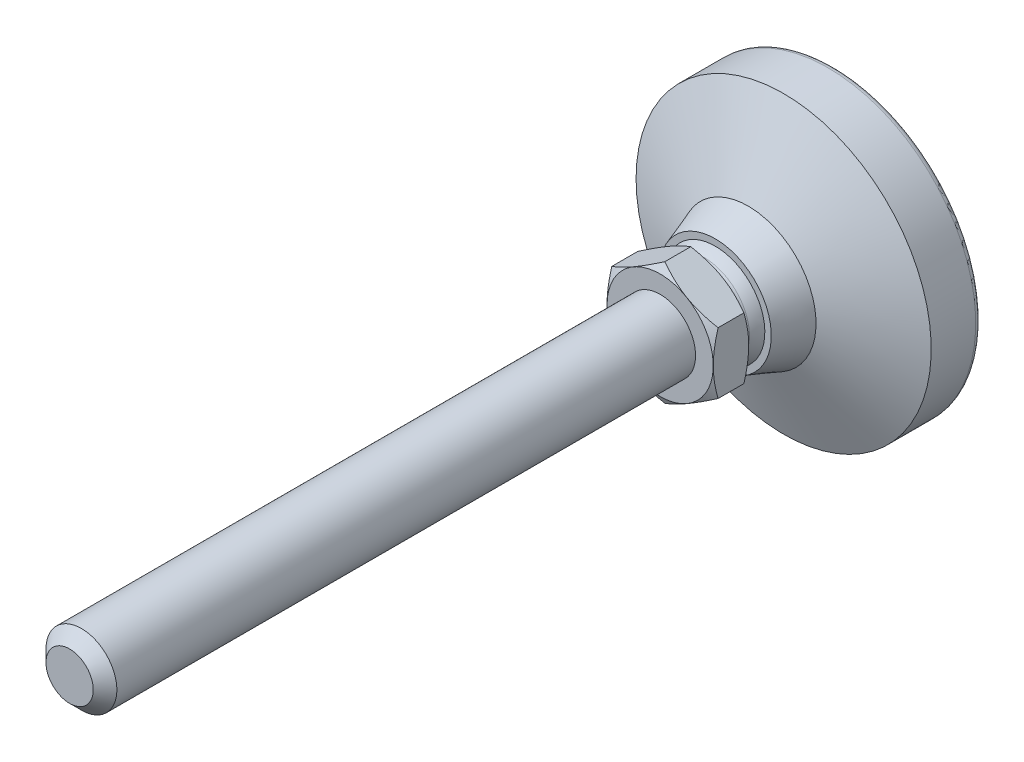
ISO-10303-21;
HEADER;
FILE_DESCRIPTION(('STEP AP214'),'2;1');
FILE_NAME('part.step','',(''),(''),'','','');
FILE_SCHEMA(('AUTOMOTIVE_DESIGN { 1 0 10303 214 1 1 1 1 }'));
ENDSEC;
DATA;
#1=APPLICATION_CONTEXT('core data for automotive mechanical design processes');
#2=APPLICATION_PROTOCOL_DEFINITION('international standard','automotive_design',2000,#1);
#3=PRODUCT_CONTEXT('',#1,'mechanical');
#4=PRODUCT('Part','Part','',(#3));
#5=PRODUCT_RELATED_PRODUCT_CATEGORY('part','',(#4));
#6=PRODUCT_DEFINITION_FORMATION('','',#4);
#7=PRODUCT_DEFINITION_CONTEXT('part definition',#1,'design');
#8=PRODUCT_DEFINITION('design','',#6,#7);
#9=PRODUCT_DEFINITION_SHAPE('','',#8);
#10=(LENGTH_UNIT() NAMED_UNIT(*) SI_UNIT(.MILLI.,.METRE.));
#11=(NAMED_UNIT(*) PLANE_ANGLE_UNIT() SI_UNIT($,.RADIAN.));
#12=(NAMED_UNIT(*) SI_UNIT($,.STERADIAN.) SOLID_ANGLE_UNIT());
#13=UNCERTAINTY_MEASURE_WITH_UNIT(LENGTH_MEASURE(1.E-05),#10,'distance_accuracy_value','');
#14=(GEOMETRIC_REPRESENTATION_CONTEXT(3) GLOBAL_UNCERTAINTY_ASSIGNED_CONTEXT((#13)) GLOBAL_UNIT_ASSIGNED_CONTEXT((#10,
#11,#12)) REPRESENTATION_CONTEXT('',''));
#15=CARTESIAN_POINT('',(0.,0.,0.));
#16=DIRECTION('',(0.,0.,1.));
#17=DIRECTION('',(1.,0.,0.));
#18=AXIS2_PLACEMENT_3D('',#15,#16,#17);
#19=CARTESIAN_POINT('',(0.,0.,24.2721236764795));
#20=DIRECTION('',(0.,0.,1.));
#21=DIRECTION('',(1.,0.,0.));
#22=AXIS2_PLACEMENT_3D('',#19,#20,#21);
#23=CONICAL_SURFACE('',#22,10.3923213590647,1.04719757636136);
#24=CARTESIAN_POINT('',(0.,0.,23.464430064));
#25=DIRECTION('',(0.,0.,-1.));
#26=DIRECTION('',(-1.,0.,0.));
#27=AXIS2_PLACEMENT_3D('',#24,#25,#26);
#28=CIRCLE('',#27,8.99335490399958);
#29=CARTESIAN_POINT('',(-8.99335490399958,0.,23.464430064));
#30=VERTEX_POINT('',#29);
#31=EDGE_CURVE('E258',#30,#30,#28,.T.);
#32=ORIENTED_EDGE('',*,*,#31,.F.);
#33=EDGE_LOOP('',(#32));
#34=FACE_BOUND('',#33,.T.);
#35=CARTESIAN_POINT('',(0.000199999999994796,10.3924203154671,24.272180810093));
#36=CARTESIAN_POINT('',(-0.197607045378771,10.2782163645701,24.2062485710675));
#37=CARTESIAN_POINT('',(-0.396185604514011,10.1635669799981,24.1433079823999));
#38=CARTESIAN_POINT('',(-0.794955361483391,9.93333715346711,24.0242355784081));
#39=CARTESIAN_POINT('',(-0.99514721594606,9.81775633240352,23.9681067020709));
#40=CARTESIAN_POINT('',(-1.39751504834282,9.585449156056,23.8634185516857));
#41=CARTESIAN_POINT('',(-1.59969458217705,9.46872074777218,23.8148773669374));
#42=CARTESIAN_POINT('',(-2.00542874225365,9.23447002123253,23.726415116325));
#43=CARTESIAN_POINT('',(-2.2089830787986,9.11694787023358,23.6864922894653));
#44=CARTESIAN_POINT('',(-2.61230588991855,8.88408933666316,23.6169512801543));
#45=CARTESIAN_POINT('',(-2.81204457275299,8.76877015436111,23.587104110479));
#46=CARTESIAN_POINT('',(-3.2124156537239,8.53761580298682,23.5370599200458));
#47=CARTESIAN_POINT('',(-3.4130479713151,8.42178068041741,23.5168620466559));
#48=CARTESIAN_POINT('',(-3.81466060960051,8.18990951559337,23.486620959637));
#49=CARTESIAN_POINT('',(-4.01564027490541,8.07387385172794,23.4765662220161));
#50=CARTESIAN_POINT('',(-4.41778456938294,7.84169573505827,23.4668289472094));
#51=CARTESIAN_POINT('',(-4.618949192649,7.72555328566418,23.4671460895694));
#52=CARTESIAN_POINT('',(-4.99503258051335,7.50842144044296,23.4774305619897));
#53=CARTESIAN_POINT('',(-5.16997786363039,7.40741673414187,23.4861433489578));
#54=CARTESIAN_POINT('',(-5.5194586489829,7.205643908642,23.5112439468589));
#55=CARTESIAN_POINT('',(-5.69399412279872,7.1048758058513,23.5276322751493));
#56=CARTESIAN_POINT('',(-6.21692485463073,6.80296160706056,23.5879231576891));
#57=CARTESIAN_POINT('',(-6.56439449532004,6.60234991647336,23.6429440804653));
#58=CARTESIAN_POINT('',(-7.26301961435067,6.19899851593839,23.7804970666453));
#59=CARTESIAN_POINT('',(-7.61408593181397,5.99631028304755,23.863612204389));
#60=CARTESIAN_POINT('',(-8.31098329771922,5.59395640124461,24.0522491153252));
#61=CARTESIAN_POINT('',(-8.65682327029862,5.39428559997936,24.1577265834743));
#62=CARTESIAN_POINT('',(-9.0002,5.19603695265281,24.2721808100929));
#63=B_SPLINE_CURVE_WITH_KNOTS('',3,(#35,#36,#37,#38,#39,#40,#41,#42,#43,#44,#45,#46,#47,#48,#49,
#50,#51,#52,#53,#54,#55,#56,#57,#58,#59,#60,#61,#62),.UNSPECIFIED.,.F.,.F.,(4,2,2,2,2,2,2,2,2,2,
2,2,2,4),(0.,0.713219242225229,1.42674512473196,2.14194695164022,2.85700250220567,
3.55449745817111,4.25193077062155,4.94857080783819,5.64518932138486,6.25162972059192,
6.85811100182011,8.07193744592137,9.31268389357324,10.5509947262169),.UNSPECIFIED.);
#64=CARTESIAN_POINT('',(0.,10.392313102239,24.2721189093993));
#65=VERTEX_POINT('',#64);
#66=CARTESIAN_POINT('',(-9.00000715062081,5.1961565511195,24.2721189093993));
#67=VERTEX_POINT('',#66);
#68=EDGE_CURVE('E9',#65,#67,#63,.T.);
#69=ORIENTED_EDGE('',*,*,#68,.F.);
#70=CARTESIAN_POINT('',(9.0002,5.19603695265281,24.2721808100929));
#71=CARTESIAN_POINT('',(8.80239295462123,5.31024090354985,24.2062485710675));
#72=CARTESIAN_POINT('',(8.60381439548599,5.42489028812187,24.1433079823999));
#73=CARTESIAN_POINT('',(8.20504463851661,5.65512011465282,24.0242355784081));
#74=CARTESIAN_POINT('',(8.00485278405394,5.77070093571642,23.9681067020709));
#75=CARTESIAN_POINT('',(7.60248495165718,6.00300811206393,23.8634185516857));
#76=CARTESIAN_POINT('',(7.40030541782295,6.11973652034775,23.8148773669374));
#77=CARTESIAN_POINT('',(6.99457125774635,6.3539872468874,23.726415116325));
#78=CARTESIAN_POINT('',(6.7910169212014,6.47150939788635,23.6864922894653));
#79=CARTESIAN_POINT('',(6.38769411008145,6.70436793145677,23.6169512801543));
#80=CARTESIAN_POINT('',(6.18795542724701,6.81968711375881,23.587104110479));
#81=CARTESIAN_POINT('',(5.7875843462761,7.05084146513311,23.5370599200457));
#82=CARTESIAN_POINT('',(5.58695202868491,7.16667658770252,23.5168620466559));
#83=CARTESIAN_POINT('',(5.18533939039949,7.39854775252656,23.486620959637));
#84=CARTESIAN_POINT('',(4.98435972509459,7.51458341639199,23.4765662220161));
#85=CARTESIAN_POINT('',(4.58221543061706,7.74676153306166,23.4668289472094));
#86=CARTESIAN_POINT('',(4.38105080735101,7.86290398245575,23.4671460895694));
#87=CARTESIAN_POINT('',(4.00496741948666,8.08003582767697,23.4774305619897));
#88=CARTESIAN_POINT('',(3.83002213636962,8.18104053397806,23.4861433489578));
#89=CARTESIAN_POINT('',(3.48054135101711,8.38281335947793,23.5112439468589));
#90=CARTESIAN_POINT('',(3.30600587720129,8.48358146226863,23.5276322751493));
#91=CARTESIAN_POINT('',(2.78307514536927,8.78549566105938,23.5879231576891));
#92=CARTESIAN_POINT('',(2.43560550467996,8.98610735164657,23.6429440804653));
#93=CARTESIAN_POINT('',(1.73698038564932,9.38945875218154,23.7804970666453));
#94=CARTESIAN_POINT('',(1.38591406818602,9.59214698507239,23.863612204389));
#95=CARTESIAN_POINT('',(0.689016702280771,9.99450086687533,24.0522491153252));
#96=CARTESIAN_POINT('',(0.343176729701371,10.1941716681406,24.1577265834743));
#97=CARTESIAN_POINT('',(-0.00020000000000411,10.3924203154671,24.272180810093));
#98=B_SPLINE_CURVE_WITH_KNOTS('',3,(#70,#71,#72,#73,#74,#75,#76,#77,#78,#79,#80,#81,#82,#83,#84,
#85,#86,#87,#88,#89,#90,#91,#92,#93,#94,#95,#96,#97),.UNSPECIFIED.,.F.,.F.,(4,2,2,2,2,2,2,2,2,2,
2,2,2,4),(0.,0.713219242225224,1.42674512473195,2.14194695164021,2.85700250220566,
3.5544974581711,4.25193077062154,4.94857080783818,5.64518932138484,6.2516297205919,
6.8581110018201,8.07193744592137,9.31268389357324,10.5509947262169),.UNSPECIFIED.);
#99=CARTESIAN_POINT('',(9.00000715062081,5.1961565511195,24.2721189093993));
#100=VERTEX_POINT('',#99);
#101=EDGE_CURVE('E70',#100,#65,#98,.T.);
#102=ORIENTED_EDGE('',*,*,#101,.F.);
#103=CARTESIAN_POINT('',(9.,-13.7804311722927,27.7747501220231));
#104=CARTESIAN_POINT('',(9.,-13.5828651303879,27.6792507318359));
#105=CARTESIAN_POINT('',(9.,-13.3850602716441,27.5842456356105));
#106=CARTESIAN_POINT('',(9.,-12.9889224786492,27.3953374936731));
#107=CARTESIAN_POINT('',(9.,-12.7905895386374,27.3014344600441));
#108=CARTESIAN_POINT('',(9.,-12.1946648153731,27.0215214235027));
#109=CARTESIAN_POINT('',(9.,-11.7962113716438,26.8373386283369));
#110=CARTESIAN_POINT('',(9.,-10.9942704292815,26.4739807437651));
#111=CARTESIAN_POINT('',(9.,-10.5907671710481,26.2948403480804));
#112=CARTESIAN_POINT('',(9.,-9.78044473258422,25.9442517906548));
#113=CARTESIAN_POINT('',(9.,-9.37362572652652,25.7728032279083));
#114=CARTESIAN_POINT('',(9.,-8.55097572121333,25.4376141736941));
#115=CARTESIAN_POINT('',(9.,-8.13509539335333,25.2739940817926));
#116=CARTESIAN_POINT('',(9.,-7.29843035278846,24.9595695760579));
#117=CARTESIAN_POINT('',(9.,-6.87764510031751,24.8087665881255));
#118=CARTESIAN_POINT('',(9.,-6.03135993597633,24.5240295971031));
#119=CARTESIAN_POINT('',(9.,-5.60587222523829,24.3900597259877));
#120=CARTESIAN_POINT('',(9.,-4.74886325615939,24.1433379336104));
#121=CARTESIAN_POINT('',(9.,-4.3173439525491,24.0305793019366));
#122=CARTESIAN_POINT('',(9.,-3.44790472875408,23.8317626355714));
#123=CARTESIAN_POINT('',(9.,-3.00998313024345,23.745711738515));
#124=CARTESIAN_POINT('',(9.,-2.34924764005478,23.64097514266));
#125=CARTESIAN_POINT('',(9.,-2.12833318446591,23.6101172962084));
#126=CARTESIAN_POINT('',(9.,-1.68546871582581,23.5571220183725));
#127=CARTESIAN_POINT('',(9.,-1.46351880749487,23.5349837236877));
#128=CARTESIAN_POINT('',(9.,-1.02029110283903,23.5000232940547));
#129=CARTESIAN_POINT('',(9.,-0.799017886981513,23.4871433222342));
#130=CARTESIAN_POINT('',(9.,-0.356124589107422,23.4707676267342));
#131=CARTESIAN_POINT('',(9.,-0.134504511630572,23.4672717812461));
#132=CARTESIAN_POINT('',(9.,0.308621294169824,23.4697476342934));
#133=CARTESIAN_POINT('',(9.,0.530127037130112,23.475716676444));
#134=CARTESIAN_POINT('',(9.,0.972693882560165,23.4969738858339));
#135=CARTESIAN_POINT('',(9.,1.19375496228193,23.5122625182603));
#136=CARTESIAN_POINT('',(9.,1.72955603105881,23.5602942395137));
#137=CARTESIAN_POINT('',(9.,2.04388419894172,23.5977077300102));
#138=CARTESIAN_POINT('',(9.,2.67013150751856,23.6893002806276));
#139=CARTESIAN_POINT('',(9.,2.98204996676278,23.7434839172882));
#140=CARTESIAN_POINT('',(9.,3.60322064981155,23.8666950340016));
#141=CARTESIAN_POINT('',(9.,3.91247006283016,23.9357365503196));
#142=CARTESIAN_POINT('',(9.,4.52778698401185,24.0865569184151));
#143=CARTESIAN_POINT('',(9.,4.83385478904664,24.1683345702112));
#144=CARTESIAN_POINT('',(9.,5.45034614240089,24.3448082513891));
#145=CARTESIAN_POINT('',(9.,5.76069258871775,24.439771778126));
#146=CARTESIAN_POINT('',(9.,6.37810510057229,24.6390806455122));
#147=CARTESIAN_POINT('',(9.,6.68517326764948,24.7434195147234));
#148=CARTESIAN_POINT('',(9.,7.29479705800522,24.9593239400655));
#149=CARTESIAN_POINT('',(9.,7.59736835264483,25.0708455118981));
#150=CARTESIAN_POINT('',(9.,8.20016350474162,25.3004336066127));
#151=CARTESIAN_POINT('',(9.,8.50038635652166,25.4185027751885));
#152=CARTESIAN_POINT('',(9.,8.79951858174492,25.5391980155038));
#153=B_SPLINE_CURVE_WITH_KNOTS('',3,(#103,#104,#105,#106,#107,#108,#109,#110,#111,#112,#113,
#114,#115,#116,#117,#118,#119,#120,#121,#122,#123,#124,#125,#126,#127,#128,#129,#130,#131,#132,
#133,#134,#135,#136,#137,#138,#139,#140,#141,#142,#143,#144,#145,#146,#147,#148,#149,#150,#151,
#152),.UNSPECIFIED.,.F.,.F.,(4,2,2,2,2,2,2,2,2,2,2,2,2,2,2,2,2,2,2,2,2,2,2,2,4),(0.,
0.65830888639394,1.31662498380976,2.63347134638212,3.95785441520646,5.28216835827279,
6.62273268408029,7.96344595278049,9.30125215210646,10.6386344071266,11.9763737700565,
12.6454062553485,13.3143724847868,13.9791224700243,14.6438638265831,15.3084186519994,
15.9730066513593,16.9221185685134,17.8714897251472,18.8217617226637,19.771944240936,
20.745415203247,21.7182193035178,22.6855475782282,23.6532696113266),.UNSPECIFIED.);
#154=CARTESIAN_POINT('',(9.00000715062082,-5.19615655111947,24.2721189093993));
#155=VERTEX_POINT('',#154);
#156=EDGE_CURVE('E75',#155,#100,#153,.T.);
#157=ORIENTED_EDGE('',*,*,#156,.F.);
#158=CARTESIAN_POINT('',(-0.000199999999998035,-10.3924203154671,24.2721808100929));
#159=CARTESIAN_POINT('',(0.197607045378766,-10.2782163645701,24.2062485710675));
#160=CARTESIAN_POINT('',(0.396185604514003,-10.163566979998,24.1433079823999));
#161=CARTESIAN_POINT('',(0.79495536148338,-9.93333715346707,24.0242355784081));
#162=CARTESIAN_POINT('',(0.995147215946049,-9.81775633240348,23.9681067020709));
#163=CARTESIAN_POINT('',(1.3975150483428,-9.58544915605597,23.8634185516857));
#164=CARTESIAN_POINT('',(1.59969458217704,-9.46872074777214,23.8148773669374));
#165=CARTESIAN_POINT('',(2.00542874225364,-9.23447002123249,23.726415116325));
#166=CARTESIAN_POINT('',(2.20898307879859,-9.11694787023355,23.6864922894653));
#167=CARTESIAN_POINT('',(2.61230588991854,-8.88408933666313,23.6169512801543));
#168=CARTESIAN_POINT('',(2.81204457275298,-8.76877015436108,23.587104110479));
#169=CARTESIAN_POINT('',(3.21241565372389,-8.53761580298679,23.5370599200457));
#170=CARTESIAN_POINT('',(3.41304797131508,-8.42178068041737,23.5168620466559));
#171=CARTESIAN_POINT('',(3.8146606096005,-8.18990951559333,23.486620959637));
#172=CARTESIAN_POINT('',(4.0156402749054,-8.0738738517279,23.4765662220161));
#173=CARTESIAN_POINT('',(4.41778456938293,-7.84169573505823,23.4668289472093));
#174=CARTESIAN_POINT('',(4.61894919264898,-7.72555328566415,23.4671460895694));
#175=CARTESIAN_POINT('',(4.99503258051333,-7.50842144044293,23.4774305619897));
#176=CARTESIAN_POINT('',(5.16997786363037,-7.40741673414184,23.4861433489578));
#177=CARTESIAN_POINT('',(5.51945864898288,-7.20564390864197,23.5112439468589));
#178=CARTESIAN_POINT('',(5.6939941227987,-7.10487580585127,23.5276322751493));
#179=CARTESIAN_POINT('',(6.21692485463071,-6.80296160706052,23.5879231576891));
#180=CARTESIAN_POINT('',(6.56439449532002,-6.60234991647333,23.6429440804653));
#181=CARTESIAN_POINT('',(7.26301961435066,-6.19899851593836,23.7804970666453));
#182=CARTESIAN_POINT('',(7.61408593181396,-5.99631028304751,23.863612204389));
#183=CARTESIAN_POINT('',(8.31098329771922,-5.59395640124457,24.0522491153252));
#184=CARTESIAN_POINT('',(8.65682327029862,-5.39428559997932,24.1577265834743));
#185=CARTESIAN_POINT('',(9.0002,-5.19603695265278,24.2721808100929));
#186=B_SPLINE_CURVE_WITH_KNOTS('',3,(#158,#159,#160,#161,#162,#163,#164,#165,#166,#167,#168,
#169,#170,#171,#172,#173,#174,#175,#176,#177,#178,#179,#180,#181,#182,#183,#184,#185),
.UNSPECIFIED.,.F.,.F.,(4,2,2,2,2,2,2,2,2,2,2,2,2,4),(0.,0.713219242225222,1.42674512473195,
2.14194695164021,2.85700250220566,3.5544974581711,4.25193077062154,4.94857080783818,
5.64518932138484,6.2516297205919,6.8581110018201,8.07193744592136,9.31268389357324,
10.5509947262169),.UNSPECIFIED.);
#187=CARTESIAN_POINT('',(0.,-10.392313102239,24.2721189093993));
#188=VERTEX_POINT('',#187);
#189=EDGE_CURVE('E95',#188,#155,#186,.T.);
#190=ORIENTED_EDGE('',*,*,#189,.F.);
#191=CARTESIAN_POINT('',(-9.0002,-5.19603695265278,24.2721808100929));
#192=CARTESIAN_POINT('',(-8.80239295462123,-5.31024090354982,24.2062485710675));
#193=CARTESIAN_POINT('',(-8.60381439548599,-5.42489028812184,24.1433079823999));
#194=CARTESIAN_POINT('',(-8.20504463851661,-5.65512011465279,24.0242355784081));
#195=CARTESIAN_POINT('',(-8.00485278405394,-5.77070093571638,23.9681067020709));
#196=CARTESIAN_POINT('',(-7.60248495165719,-6.00300811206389,23.8634185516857));
#197=CARTESIAN_POINT('',(-7.40030541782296,-6.11973652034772,23.8148773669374));
#198=CARTESIAN_POINT('',(-6.99457125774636,-6.35398724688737,23.726415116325));
#199=CARTESIAN_POINT('',(-6.79101692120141,-6.47150939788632,23.6864922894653));
#200=CARTESIAN_POINT('',(-6.38769411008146,-6.70436793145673,23.6169512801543));
#201=CARTESIAN_POINT('',(-6.18795542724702,-6.81968711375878,23.587104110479));
#202=CARTESIAN_POINT('',(-5.78758434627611,-7.05084146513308,23.5370599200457));
#203=CARTESIAN_POINT('',(-5.58695202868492,-7.16667658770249,23.5168620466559));
#204=CARTESIAN_POINT('',(-5.1853393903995,-7.39854775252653,23.486620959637));
#205=CARTESIAN_POINT('',(-4.9843597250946,-7.51458341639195,23.4765662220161));
#206=CARTESIAN_POINT('',(-4.58221543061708,-7.74676153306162,23.4668289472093));
#207=CARTESIAN_POINT('',(-4.38105080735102,-7.86290398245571,23.4671460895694));
#208=CARTESIAN_POINT('',(-4.00496741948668,-8.08003582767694,23.4774305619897));
#209=CARTESIAN_POINT('',(-3.83002213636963,-8.18104053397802,23.4861433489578));
#210=CARTESIAN_POINT('',(-3.48054135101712,-8.38281335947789,23.5112439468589));
#211=CARTESIAN_POINT('',(-3.3060058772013,-8.48358146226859,23.5276322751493));
#212=CARTESIAN_POINT('',(-2.78307514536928,-8.78549566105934,23.5879231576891));
#213=CARTESIAN_POINT('',(-2.43560550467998,-8.98610735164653,23.6429440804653));
#214=CARTESIAN_POINT('',(-1.73698038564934,-9.38945875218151,23.7804970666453));
#215=CARTESIAN_POINT('',(-1.38591406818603,-9.59214698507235,23.863612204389));
#216=CARTESIAN_POINT('',(-0.689016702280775,-9.9945008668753,24.0522491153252));
#217=CARTESIAN_POINT('',(-0.343176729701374,-10.1941716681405,24.1577265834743));
#218=CARTESIAN_POINT('',(0.000200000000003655,-10.3924203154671,24.2721808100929));
#219=B_SPLINE_CURVE_WITH_KNOTS('',3,(#191,#192,#193,#194,#195,#196,#197,#198,#199,#200,#201,
#202,#203,#204,#205,#206,#207,#208,#209,#210,#211,#212,#213,#214,#215,#216,#217,#218),
.UNSPECIFIED.,.F.,.F.,(4,2,2,2,2,2,2,2,2,2,2,2,2,4),(0.,0.713219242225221,1.42674512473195,
2.1419469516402,2.85700250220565,3.55449745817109,4.25193077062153,4.94857080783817,
5.64518932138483,6.25162972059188,6.85811100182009,8.07193744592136,9.31268389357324,
10.5509947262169),.UNSPECIFIED.);
#220=CARTESIAN_POINT('',(-9.00000715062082,-5.19615655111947,24.2721189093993));
#221=VERTEX_POINT('',#220);
#222=EDGE_CURVE('E90',#221,#188,#219,.T.);
#223=ORIENTED_EDGE('',*,*,#222,.F.);
#224=CARTESIAN_POINT('',(-9.,-13.7804311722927,27.7747501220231));
#225=CARTESIAN_POINT('',(-9.,-13.5828651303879,27.6792507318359));
#226=CARTESIAN_POINT('',(-9.,-13.3850602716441,27.5842456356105));
#227=CARTESIAN_POINT('',(-9.,-12.9889224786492,27.3953374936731));
#228=CARTESIAN_POINT('',(-9.,-12.7905895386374,27.3014344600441));
#229=CARTESIAN_POINT('',(-9.,-12.1946648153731,27.0215214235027));
#230=CARTESIAN_POINT('',(-9.,-11.7962113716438,26.8373386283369));
#231=CARTESIAN_POINT('',(-9.,-10.9942704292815,26.4739807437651));
#232=CARTESIAN_POINT('',(-9.,-10.5907671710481,26.2948403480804));
#233=CARTESIAN_POINT('',(-9.,-9.78044473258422,25.9442517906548));
#234=CARTESIAN_POINT('',(-9.,-9.37362572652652,25.7728032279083));
#235=CARTESIAN_POINT('',(-9.,-8.55097572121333,25.4376141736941));
#236=CARTESIAN_POINT('',(-9.,-8.13509539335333,25.2739940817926));
#237=CARTESIAN_POINT('',(-9.,-7.29843035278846,24.9595695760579));
#238=CARTESIAN_POINT('',(-9.,-6.87764510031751,24.8087665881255));
#239=CARTESIAN_POINT('',(-9.,-6.03135993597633,24.5240295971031));
#240=CARTESIAN_POINT('',(-9.,-5.60587222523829,24.3900597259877));
#241=CARTESIAN_POINT('',(-9.,-4.74886325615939,24.1433379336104));
#242=CARTESIAN_POINT('',(-9.,-4.3173439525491,24.0305793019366));
#243=CARTESIAN_POINT('',(-9.,-3.44790472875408,23.8317626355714));
#244=CARTESIAN_POINT('',(-9.,-3.00998313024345,23.745711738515));
#245=CARTESIAN_POINT('',(-9.,-2.34924764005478,23.64097514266));
#246=CARTESIAN_POINT('',(-9.,-2.12833318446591,23.6101172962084));
#247=CARTESIAN_POINT('',(-9.,-1.68546871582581,23.5571220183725));
#248=CARTESIAN_POINT('',(-9.,-1.46351880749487,23.5349837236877));
#249=CARTESIAN_POINT('',(-9.,-1.02029110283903,23.5000232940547));
#250=CARTESIAN_POINT('',(-9.,-0.799017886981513,23.4871433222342));
#251=CARTESIAN_POINT('',(-9.,-0.356124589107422,23.4707676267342));
#252=CARTESIAN_POINT('',(-9.,-0.134504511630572,23.4672717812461));
#253=CARTESIAN_POINT('',(-9.,0.308621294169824,23.4697476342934));
#254=CARTESIAN_POINT('',(-9.,0.530127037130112,23.475716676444));
#255=CARTESIAN_POINT('',(-9.,0.972693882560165,23.4969738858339));
#256=CARTESIAN_POINT('',(-9.,1.19375496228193,23.5122625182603));
#257=CARTESIAN_POINT('',(-9.,1.72955603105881,23.5602942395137));
#258=CARTESIAN_POINT('',(-9.,2.04388419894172,23.5977077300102));
#259=CARTESIAN_POINT('',(-9.,2.67013150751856,23.6893002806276));
#260=CARTESIAN_POINT('',(-9.,2.98204996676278,23.7434839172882));
#261=CARTESIAN_POINT('',(-9.,3.60322064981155,23.8666950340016));
#262=CARTESIAN_POINT('',(-9.,3.91247006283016,23.9357365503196));
#263=CARTESIAN_POINT('',(-9.,4.52778698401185,24.0865569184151));
#264=CARTESIAN_POINT('',(-9.,4.83385478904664,24.1683345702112));
#265=CARTESIAN_POINT('',(-9.,5.45034614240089,24.3448082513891));
#266=CARTESIAN_POINT('',(-9.,5.76069258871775,24.439771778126));
#267=CARTESIAN_POINT('',(-9.,6.37810510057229,24.6390806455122));
#268=CARTESIAN_POINT('',(-9.,6.68517326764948,24.7434195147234));
#269=CARTESIAN_POINT('',(-9.,7.29479705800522,24.9593239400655));
#270=CARTESIAN_POINT('',(-9.,7.59736835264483,25.0708455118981));
#271=CARTESIAN_POINT('',(-9.,8.20016350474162,25.3004336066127));
#272=CARTESIAN_POINT('',(-9.,8.50038635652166,25.4185027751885));
#273=CARTESIAN_POINT('',(-9.,8.79951858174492,25.5391980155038));
#274=B_SPLINE_CURVE_WITH_KNOTS('',3,(#224,#225,#226,#227,#228,#229,#230,#231,#232,#233,#234,
#235,#236,#237,#238,#239,#240,#241,#242,#243,#244,#245,#246,#247,#248,#249,#250,#251,#252,#253,
#254,#255,#256,#257,#258,#259,#260,#261,#262,#263,#264,#265,#266,#267,#268,#269,#270,#271,#272,
#273),.UNSPECIFIED.,.F.,.F.,(4,2,2,2,2,2,2,2,2,2,2,2,2,2,2,2,2,2,2,2,2,2,2,2,4),(0.,
0.65830888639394,1.31662498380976,2.63347134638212,3.95785441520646,5.28216835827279,
6.62273268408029,7.96344595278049,9.30125215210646,10.6386344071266,11.9763737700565,
12.6454062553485,13.3143724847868,13.9791224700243,14.6438638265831,15.3084186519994,
15.9730066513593,16.9221185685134,17.8714897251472,18.8217617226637,19.771944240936,
20.745415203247,21.7182193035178,22.6855475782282,23.6532696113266),.UNSPECIFIED.);
#275=EDGE_CURVE('E29',#67,#221,#274,.F.);
#276=ORIENTED_EDGE('',*,*,#275,.F.);
#277=EDGE_LOOP('',(#69,#102,#157,#190,#223,#276));
#278=FACE_BOUND('',#277,.T.);
#279=ADVANCED_FACE('F14',(#34,#278),#23,.T.);
#280=CARTESIAN_POINT('',(0.,6.27010388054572E-08,17.7237569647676));
#281=DIRECTION('',(0.,0.,-1.));
#282=DIRECTION('',(0.,-1.,0.));
#283=AXIS2_PLACEMENT_3D('',#280,#281,#282);
#284=SPHERICAL_SURFACE('',#283,8.74999992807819);
#285=CARTESIAN_POINT('',(0.,0.,20.135983));
#286=DIRECTION('',(0.,0.,-1.));
#287=DIRECTION('',(-1.,0.,0.));
#288=AXIS2_PLACEMENT_3D('',#285,#286,#287);
#289=CIRCLE('',#288,8.41092523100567);
#290=CARTESIAN_POINT('',(0.,-8.41092523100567,20.135983));
#291=VERTEX_POINT('',#290);
#292=EDGE_CURVE('E76',#291,#291,#289,.T.);
#293=CARTESIAN_POINT('',(0.,0.,21.9782071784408));
#294=DIRECTION('',(0.,0.,-1.));
#295=DIRECTION('',(-1.,0.,0.));
#296=AXIS2_PLACEMENT_3D('',#293,#294,#295);
#297=CIRCLE('',#296,7.64605461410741);
#298=CARTESIAN_POINT('',(0.,-7.64605461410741,21.9782071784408));
#299=VERTEX_POINT('',#298);
#300=EDGE_CURVE('E200',#299,#299,#297,.T.);
#301=CARTESIAN_POINT('',(0.,-8.41092523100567,20.135983));
#302=CARTESIAN_POINT('',(0.,-8.40518458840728,20.1559994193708));
#303=CARTESIAN_POINT('',(0.,-8.39937249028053,20.1759953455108));
#304=CARTESIAN_POINT('',(0.,-8.38760568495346,20.215945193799));
#305=CARTESIAN_POINT('',(0.,-8.38165097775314,20.2358991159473));
#306=CARTESIAN_POINT('',(0.,-8.36959925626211,20.2757639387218));
#307=CARTESIAN_POINT('',(0.,-8.3635022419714,20.2956748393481));
#308=CARTESIAN_POINT('',(0.,-8.35116621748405,20.3354526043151));
#309=CARTESIAN_POINT('',(0.,-8.34492720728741,20.3553194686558));
#310=CARTESIAN_POINT('',(0.,-8.33230750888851,20.3950081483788));
#311=CARTESIAN_POINT('',(0.,-8.32592682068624,20.4148299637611));
#312=CARTESIAN_POINT('',(0.,-8.31302409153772,20.4544275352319));
#313=CARTESIAN_POINT('',(0.,-8.30650205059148,20.4742032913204));
#314=CARTESIAN_POINT('',(0.,-8.29331694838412,20.513707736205));
#315=CARTESIAN_POINT('',(0.,-8.28665388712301,20.533436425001));
#316=CARTESIAN_POINT('',(0.,-8.27318708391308,20.5728457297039));
#317=CARTESIAN_POINT('',(0.,-8.26638334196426,20.5925263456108));
#318=CARTESIAN_POINT('',(0.,-8.25263552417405,20.6318385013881));
#319=CARTESIAN_POINT('',(0.,-8.24569144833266,20.6514700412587));
#320=CARTESIAN_POINT('',(0.,-8.23166331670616,20.690683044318));
#321=CARTESIAN_POINT('',(0.,-8.22457926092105,20.7102645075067));
#322=CARTESIAN_POINT('',(0.,-8.21027153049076,20.7493763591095));
#323=CARTESIAN_POINT('',(0.,-8.20304785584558,20.7689067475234));
#324=CARTESIAN_POINT('',(0.,-8.18846125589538,20.8079154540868));
#325=CARTESIAN_POINT('',(0.,-8.18109833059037,20.8273937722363));
#326=CARTESIAN_POINT('',(0.,-8.16623360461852,20.8662973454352));
#327=CARTESIAN_POINT('',(0.,-8.15873180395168,20.8857226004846));
#328=CARTESIAN_POINT('',(0.,-8.14358970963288,20.9245190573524));
#329=CARTESIAN_POINT('',(0.,-8.13594941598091,20.9438902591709));
#330=CARTESIAN_POINT('',(0.,-8.1205307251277,20.9825776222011));
#331=CARTESIAN_POINT('',(0.,-8.11275232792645,21.0018937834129));
#332=CARTESIAN_POINT('',(0.,-8.09705782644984,21.0404700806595));
#333=CARTESIAN_POINT('',(0.,-8.08914172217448,21.0597302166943));
#334=CARTESIAN_POINT('',(0.,-8.07317221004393,21.0981934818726));
#335=CARTESIAN_POINT('',(0.,-8.06511880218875,21.117396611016));
#336=CARTESIAN_POINT('',(0.,-8.04887509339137,21.1557448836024));
#337=CARTESIAN_POINT('',(0.,-8.04068479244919,21.1748900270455));
#338=CARTESIAN_POINT('',(0.,-8.02416771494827,21.2131213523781));
#339=CARTESIAN_POINT('',(0.,-8.01584093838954,21.2322075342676));
#340=CARTESIAN_POINT('',(0.,-7.99905133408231,21.2703199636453));
#341=CARTESIAN_POINT('',(0.,-7.99058850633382,21.2893462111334));
#342=CARTESIAN_POINT('',(0.,-7.97352723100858,21.3273378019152));
#343=CARTESIAN_POINT('',(0.,-7.96492878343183,21.3463031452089));
#344=CARTESIAN_POINT('',(0.,-7.94759670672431,21.3841719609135));
#345=CARTESIAN_POINT('',(0.,-7.93886307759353,21.4030754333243));
#346=CARTESIAN_POINT('',(0.,-7.92126108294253,21.4408195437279));
#347=CARTESIAN_POINT('',(0.,-7.91239271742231,21.4596601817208));
#348=CARTESIAN_POINT('',(0.,-7.89452170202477,21.4972776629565));
#349=CARTESIAN_POINT('',(0.,-7.88551905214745,21.5160545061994));
#350=CARTESIAN_POINT('',(0.,-7.86737992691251,21.5535434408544));
#351=CARTESIAN_POINT('',(0.,-7.85824345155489,21.5722555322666));
#352=CARTESIAN_POINT('',(0.,-7.83983714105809,21.6096140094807));
#353=CARTESIAN_POINT('',(0.,-7.8305673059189,21.6282603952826));
#354=CARTESIAN_POINT('',(0.,-7.81189474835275,21.665486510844));
#355=CARTESIAN_POINT('',(0.,-7.80249202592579,21.6840662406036));
#356=CARTESIAN_POINT('',(0.,-7.7835541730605,21.7211580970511));
#357=CARTESIAN_POINT('',(0.,-7.77401904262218,21.739670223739));
#358=CARTESIAN_POINT('',(0.,-7.75481685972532,21.7766259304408));
#359=CARTESIAN_POINT('',(0.,-7.74514980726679,21.7950695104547));
#360=CARTESIAN_POINT('',(0.,-7.72568427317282,21.8318871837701));
#361=CARTESIAN_POINT('',(0.,-7.71588579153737,21.8502612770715));
#362=CARTESIAN_POINT('',(0.,-7.69615789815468,21.8869390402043));
#363=CARTESIAN_POINT('',(0.,-7.68622848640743,21.9052427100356));
#364=CARTESIAN_POINT('',(0.,-7.6662392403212,21.9417786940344));
#365=CARTESIAN_POINT('',(0.,-7.65617940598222,21.960011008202));
#366=CARTESIAN_POINT('',(0.,-7.64605461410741,21.9782071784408));
#367=B_SPLINE_CURVE_WITH_KNOTS('',3,(#301,#302,#303,#304,#305,#306,#307,#308,#309,#310,#311,
#312,#313,#314,#315,#316,#317,#318,#319,#320,#321,#322,#323,#324,#325,#326,#327,#328,#329,#330,
#331,#332,#333,#334,#335,#336,#337,#338,#339,#340,#341,#342,#343,#344,#345,#346,#347,#348,#349,
#350,#351,#352,#353,#354,#355,#356,#357,#358,#359,#360,#361,#362,#363,#364,#365,#366),
.UNSPECIFIED.,.F.,.F.,(4,2,2,2,2,2,2,2,2,2,2,2,2,2,2,2,2,2,2,2,2,2,2,2,2,2,2,2,2,2,2,2,4),(0.,
0.0624699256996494,0.124939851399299,0.187409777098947,0.249879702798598,0.312349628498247,
0.374819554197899,0.437289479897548,0.499759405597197,0.562229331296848,0.624699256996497,
0.687169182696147,0.749639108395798,0.812109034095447,0.874578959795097,0.937048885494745,
0.999518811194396,1.06198873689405,1.12445866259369,1.18692858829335,1.24939851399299,
1.31186843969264,1.3743383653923,1.43680829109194,1.49927821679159,1.56174814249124,
1.62421806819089,1.68668799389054,1.74915791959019,1.81162784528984,1.87409777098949,
1.93656769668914,1.99903762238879),.UNSPECIFIED.);
#368=EDGE_CURVE('BSEAM16',#291,#299,#367,.T.);
#369=ORIENTED_EDGE('',*,*,#292,.F.);
#370=ORIENTED_EDGE('',*,*,#300,.T.);
#371=ORIENTED_EDGE('',*,*,#368,.T.);
#372=ORIENTED_EDGE('',*,*,#368,.F.);
#373=EDGE_LOOP('',(#369,#371,#370,#372));
#374=FACE_BOUND('',#373,.T.);
#375=ADVANCED_FACE('F16',(#374),#284,.T.);
#376=CARTESIAN_POINT('',(0.,-8.41092523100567,20.135983));
#377=DIRECTION('',(0.,0.,-1.));
#378=DIRECTION('',(-1.,0.,0.));
#379=AXIS2_PLACEMENT_3D('',#376,#377,#378);
#380=PLANE('',#379);
#381=CARTESIAN_POINT('',(0.,0.,20.135983));
#382=DIRECTION('',(0.,0.,-1.));
#383=DIRECTION('',(-1.,0.,0.));
#384=AXIS2_PLACEMENT_3D('',#381,#382,#383);
#385=CIRCLE('',#384,9.5);
#386=CARTESIAN_POINT('',(-9.5,0.,20.135983));
#387=VERTEX_POINT('',#386);
#388=EDGE_CURVE('E284',#387,#387,#385,.T.);
#389=ORIENTED_EDGE('',*,*,#388,.F.);
#390=EDGE_LOOP('',(#389));
#391=FACE_BOUND('',#390,.T.);
#392=ORIENTED_EDGE('',*,*,#292,.T.);
#393=EDGE_LOOP('',(#392));
#394=FACE_BOUND('',#393,.T.);
#395=ADVANCED_FACE('F290',(#391,#394),#380,.F.);
#396=CARTESIAN_POINT('',(0.,0.,20.135983));
#397=DIRECTION('',(0.,0.,-1.));
#398=DIRECTION('',(-1.,0.,0.));
#399=AXIS2_PLACEMENT_3D('',#396,#397,#398);
#400=CONICAL_SURFACE('',#399,9.5,0.341083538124);
#401=CARTESIAN_POINT('',(0.,0.,14.540001));
#402=DIRECTION('',(0.,0.,-1.));
#403=DIRECTION('',(-1.,0.,0.));
#404=AXIS2_PLACEMENT_3D('',#401,#402,#403);
#405=CIRCLE('',#404,11.48633);
#406=CARTESIAN_POINT('',(-11.48633,0.,14.540001));
#407=VERTEX_POINT('',#406);
#408=EDGE_CURVE('E281',#407,#407,#405,.T.);
#409=ORIENTED_EDGE('',*,*,#408,.F.);
#410=EDGE_LOOP('',(#409));
#411=FACE_BOUND('',#410,.T.);
#412=ORIENTED_EDGE('',*,*,#388,.T.);
#413=EDGE_LOOP('',(#412));
#414=FACE_BOUND('',#413,.T.);
#415=ADVANCED_FACE('F329',(#411,#414),#400,.T.);
#416=CARTESIAN_POINT('',(0.,0.,14.540001));
#417=DIRECTION('',(0.,0.,-1.));
#418=DIRECTION('',(-1.,0.,0.));
#419=AXIS2_PLACEMENT_3D('',#416,#417,#418);
#420=CONICAL_SURFACE('',#419,11.48633,1.15294748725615);
#421=CARTESIAN_POINT('',(0.,0.,8.540001));
#422=DIRECTION('',(0.,0.,-1.));
#423=DIRECTION('',(-1.,0.,0.));
#424=AXIS2_PLACEMENT_3D('',#421,#422,#423);
#425=CIRCLE('',#424,25.);
#426=CARTESIAN_POINT('',(-25.,0.,8.540001));
#427=VERTEX_POINT('',#426);
#428=EDGE_CURVE('E278',#427,#427,#425,.T.);
#429=ORIENTED_EDGE('',*,*,#428,.F.);
#430=EDGE_LOOP('',(#429));
#431=FACE_BOUND('',#430,.T.);
#432=ORIENTED_EDGE('',*,*,#408,.T.);
#433=EDGE_LOOP('',(#432));
#434=FACE_BOUND('',#433,.T.);
#435=ADVANCED_FACE('F325',(#431,#434),#420,.T.);
#436=CARTESIAN_POINT('',(0.,0.,0.));
#437=DIRECTION('',(0.,0.,-1.));
#438=DIRECTION('',(-1.,0.,0.));
#439=AXIS2_PLACEMENT_3D('',#436,#437,#438);
#440=CYLINDRICAL_SURFACE('',#439,25.);
#441=CARTESIAN_POINT('',(0.,0.,1.));
#442=DIRECTION('',(0.,0.,-1.));
#443=DIRECTION('',(-1.,0.,0.));
#444=AXIS2_PLACEMENT_3D('',#441,#442,#443);
#445=CIRCLE('',#444,25.);
#446=CARTESIAN_POINT('',(-25.,0.,1.));
#447=VERTEX_POINT('',#446);
#448=EDGE_CURVE('E275',#447,#447,#445,.T.);
#449=ORIENTED_EDGE('',*,*,#448,.F.);
#450=EDGE_LOOP('',(#449));
#451=FACE_BOUND('',#450,.T.);
#452=ORIENTED_EDGE('',*,*,#428,.T.);
#453=EDGE_LOOP('',(#452));
#454=FACE_BOUND('',#453,.T.);
#455=ADVANCED_FACE('F317',(#451,#454),#440,.T.);
#456=CARTESIAN_POINT('',(0.,0.,1.));
#457=DIRECTION('',(0.,0.,-1.));
#458=DIRECTION('',(-1.,0.,0.));
#459=AXIS2_PLACEMENT_3D('',#456,#457,#458);
#460=TOROIDAL_SURFACE('',#459,24.,1.);
#461=CARTESIAN_POINT('',(0.,0.,0.));
#462=DIRECTION('',(0.,0.,-1.));
#463=DIRECTION('',(-1.,0.,0.));
#464=AXIS2_PLACEMENT_3D('',#461,#462,#463);
#465=CIRCLE('',#464,24.);
#466=CARTESIAN_POINT('',(-24.,0.,0.));
#467=VERTEX_POINT('',#466);
#468=EDGE_CURVE('E272',#467,#467,#465,.T.);
#469=ORIENTED_EDGE('',*,*,#468,.F.);
#470=EDGE_LOOP('',(#469));
#471=FACE_BOUND('',#470,.T.);
#472=ORIENTED_EDGE('',*,*,#448,.T.);
#473=EDGE_LOOP('',(#472));
#474=FACE_BOUND('',#473,.T.);
#475=ADVANCED_FACE('F310',(#471,#474),#460,.T.);
#476=CARTESIAN_POINT('',(0.,-24.,0.));
#477=DIRECTION('',(0.,0.,1.));
#478=DIRECTION('',(1.,0.,0.));
#479=AXIS2_PLACEMENT_3D('',#476,#477,#478);
#480=PLANE('',#479);
#481=ORIENTED_EDGE('',*,*,#468,.T.);
#482=EDGE_LOOP('',(#481));
#483=FACE_BOUND('',#482,.T.);
#484=ADVANCED_FACE('F303',(#483),#480,.F.);
#485=CARTESIAN_POINT('',(0.,-8.99335490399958,23.464430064));
#486=DIRECTION('',(0.,0.,1.));
#487=DIRECTION('',(1.,0.,0.));
#488=AXIS2_PLACEMENT_3D('',#485,#486,#487);
#489=PLANE('',#488);
#490=CARTESIAN_POINT('',(0.,0.,23.464430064));
#491=DIRECTION('',(0.,0.,-1.));
#492=DIRECTION('',(-1.,0.,0.));
#493=AXIS2_PLACEMENT_3D('',#490,#491,#492);
#494=CIRCLE('',#493,8.5198894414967);
#495=CARTESIAN_POINT('',(-8.5198894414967,0.,23.464430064));
#496=VERTEX_POINT('',#495);
#497=EDGE_CURVE('E264',#496,#496,#494,.T.);
#498=ORIENTED_EDGE('',*,*,#497,.F.);
#499=EDGE_LOOP('',(#498));
#500=FACE_BOUND('',#499,.T.);
#501=ORIENTED_EDGE('',*,*,#31,.T.);
#502=EDGE_LOOP('',(#501));
#503=FACE_BOUND('',#502,.T.);
#504=ADVANCED_FACE('F118',(#500,#503),#489,.F.);
#505=CARTESIAN_POINT('',(0.,0.,22.464430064));
#506=DIRECTION('',(0.,0.,-1.));
#507=DIRECTION('',(-1.,0.,0.));
#508=AXIS2_PLACEMENT_3D('',#505,#506,#507);
#509=TOROIDAL_SURFACE('',#508,8.5198894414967,1.);
#510=ORIENTED_EDGE('',*,*,#300,.F.);
#511=EDGE_LOOP('',(#510));
#512=FACE_BOUND('',#511,.T.);
#513=ORIENTED_EDGE('',*,*,#497,.T.);
#514=EDGE_LOOP('',(#513));
#515=FACE_BOUND('',#514,.T.);
#516=ADVANCED_FACE('F210',(#512,#515),#509,.F.);
#517=CARTESIAN_POINT('',(0.,10.3923048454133,-4.03102410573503));
#518=DIRECTION('',(-0.5,0.866025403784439,0.));
#519=DIRECTION('',(-0.866025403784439,-0.5,0.));
#520=AXIS2_PLACEMENT_3D('',#517,#518,#519);
#521=PLANE('',#520);
#522=CARTESIAN_POINT('',(-9.0002,5.19603695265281,28.652249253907));
#523=CARTESIAN_POINT('',(-8.80239295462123,5.31024090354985,28.7181814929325));
#524=CARTESIAN_POINT('',(-8.60381439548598,5.42489028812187,28.7811220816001));
#525=CARTESIAN_POINT('',(-8.2050446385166,5.65512011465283,28.9001944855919));
#526=CARTESIAN_POINT('',(-8.00485278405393,5.77070093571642,28.9563233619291));
#527=CARTESIAN_POINT('',(-7.60248495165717,6.00300811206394,29.0610115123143));
#528=CARTESIAN_POINT('',(-7.40030541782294,6.11973652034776,29.1095526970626));
#529=CARTESIAN_POINT('',(-6.99457125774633,6.35398724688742,29.198014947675));
#530=CARTESIAN_POINT('',(-6.79101692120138,6.47150939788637,29.2379377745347));
#531=CARTESIAN_POINT('',(-6.38769411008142,6.70436793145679,29.3074787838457));
#532=CARTESIAN_POINT('',(-6.18795542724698,6.81968711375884,29.337325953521));
#533=CARTESIAN_POINT('',(-5.78758434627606,7.05084146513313,29.3873701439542));
#534=CARTESIAN_POINT('',(-5.58695202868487,7.16667658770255,29.4075680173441));
#535=CARTESIAN_POINT('',(-5.18533939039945,7.39854775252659,29.437809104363));
#536=CARTESIAN_POINT('',(-4.98435972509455,7.51458341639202,29.4478638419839));
#537=CARTESIAN_POINT('',(-4.58221543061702,7.74676153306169,29.4576011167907));
#538=CARTESIAN_POINT('',(-4.38105080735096,7.86290398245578,29.4572839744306));
#539=CARTESIAN_POINT('',(-4.00496741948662,8.080035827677,29.4469995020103));
#540=CARTESIAN_POINT('',(-3.83002213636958,8.18104053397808,29.4382867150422));
#541=CARTESIAN_POINT('',(-3.48054135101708,8.38281335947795,29.4131861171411));
#542=CARTESIAN_POINT('',(-3.30600587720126,8.48358146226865,29.3967977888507));
#543=CARTESIAN_POINT('',(-2.78307514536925,8.78549566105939,29.3365069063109));
#544=CARTESIAN_POINT('',(-2.43560550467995,8.98610735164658,29.2814859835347));
#545=CARTESIAN_POINT('',(-1.73698038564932,9.38945875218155,29.1439329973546));
#546=CARTESIAN_POINT('',(-1.38591406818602,9.59214698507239,29.0608178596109));
#547=CARTESIAN_POINT('',(-0.689016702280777,9.99450086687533,28.8721809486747));
#548=CARTESIAN_POINT('',(-0.343176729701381,10.1941716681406,28.7667034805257));
#549=CARTESIAN_POINT('',(0.000199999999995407,10.3924203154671,28.652249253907));
#550=B_SPLINE_CURVE_WITH_KNOTS('',3,(#522,#523,#524,#525,#526,#527,#528,#529,#530,#531,#532,
#533,#534,#535,#536,#537,#538,#539,#540,#541,#542,#543,#544,#545,#546,#547,#548,#549),
.UNSPECIFIED.,.F.,.F.,(4,2,2,2,2,2,2,2,2,2,2,2,2,4),(0.,0.713219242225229,1.42674512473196,
2.14194695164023,2.8570025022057,3.55449745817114,4.25193077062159,4.94857080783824,
5.6451893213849,6.25162972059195,6.85811100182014,8.07193744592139,9.31268389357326,
10.5509947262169),.UNSPECIFIED.);
#551=CARTESIAN_POINT('',(-9.00000715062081,5.1961565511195,28.6523111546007));
#552=VERTEX_POINT('',#551);
#553=CARTESIAN_POINT('',(0.,10.392313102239,28.6523111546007));
#554=VERTEX_POINT('',#553);
#555=EDGE_CURVE('E83',#552,#554,#550,.T.);
#556=ORIENTED_EDGE('',*,*,#555,.T.);
#557=DIRECTION('',(0.,0.,1.));
#558=VECTOR('',#557,1.);
#559=CARTESIAN_POINT('',(0.,10.3923048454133,-4.03102410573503));
#560=LINE('',#559,#558);
#561=EDGE_CURVE('E36',#65,#554,#560,.T.);
#562=ORIENTED_EDGE('',*,*,#561,.F.);
#563=ORIENTED_EDGE('',*,*,#68,.T.);
#564=DIRECTION('',(0.,0.,1.));
#565=VECTOR('',#564,1.);
#566=CARTESIAN_POINT('',(-9.,5.19615242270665,-4.03102410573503));
#567=LINE('',#566,#565);
#568=EDGE_CURVE('E85',#67,#552,#567,.T.);
#569=ORIENTED_EDGE('',*,*,#568,.T.);
#570=EDGE_LOOP('',(#556,#562,#563,#569));
#571=FACE_BOUND('',#570,.T.);
#572=ADVANCED_FACE('F79',(#571),#521,.T.);
#573=CARTESIAN_POINT('',(-9.,5.19615242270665,-4.03102410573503));
#574=DIRECTION('',(-1.,0.,0.));
#575=DIRECTION('',(0.,-1.,0.));
#576=AXIS2_PLACEMENT_3D('',#573,#574,#575);
#577=PLANE('',#576);
#578=CARTESIAN_POINT('',(-9.,-13.7804311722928,25.1496799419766));
#579=CARTESIAN_POINT('',(-9.,-13.5828651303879,25.2451793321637));
#580=CARTESIAN_POINT('',(-9.,-13.3850602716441,25.3401844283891));
#581=CARTESIAN_POINT('',(-9.,-12.9889224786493,25.5290925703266));
#582=CARTESIAN_POINT('',(-9.,-12.7905895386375,25.6229956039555));
#583=CARTESIAN_POINT('',(-9.,-12.1946648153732,25.902908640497));
#584=CARTESIAN_POINT('',(-9.,-11.7962113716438,26.0870914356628));
#585=CARTESIAN_POINT('',(-9.,-10.9942704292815,26.4504493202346));
#586=CARTESIAN_POINT('',(-9.,-10.5907671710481,26.6295897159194));
#587=CARTESIAN_POINT('',(-9.,-9.78044473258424,26.980178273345));
#588=CARTESIAN_POINT('',(-9.,-9.37362572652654,27.1516268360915));
#589=CARTESIAN_POINT('',(-9.,-8.55097572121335,27.4868158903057));
#590=CARTESIAN_POINT('',(-9.,-8.13509539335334,27.6504359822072));
#591=CARTESIAN_POINT('',(-9.,-7.29843035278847,27.9648604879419));
#592=CARTESIAN_POINT('',(-9.,-6.87764510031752,28.1156634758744));
#593=CARTESIAN_POINT('',(-9.,-6.03135993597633,28.4004004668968));
#594=CARTESIAN_POINT('',(-9.,-5.60587222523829,28.5343703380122));
#595=CARTESIAN_POINT('',(-9.,-4.74886325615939,28.7810921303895));
#596=CARTESIAN_POINT('',(-9.,-4.3173439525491,28.8938507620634));
#597=CARTESIAN_POINT('',(-9.,-3.44790472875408,29.0926674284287));
#598=CARTESIAN_POINT('',(-9.,-3.00998313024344,29.178718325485));
#599=CARTESIAN_POINT('',(-9.,-2.34924764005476,29.2834549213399));
#600=CARTESIAN_POINT('',(-9.,-2.12833318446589,29.3143127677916));
#601=CARTESIAN_POINT('',(-9.,-1.68546871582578,29.3673080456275));
#602=CARTESIAN_POINT('',(-9.,-1.46351880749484,29.3894463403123));
#603=CARTESIAN_POINT('',(-9.,-1.02029110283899,29.4244067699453));
#604=CARTESIAN_POINT('',(-9.,-0.799017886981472,29.4372867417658));
#605=CARTESIAN_POINT('',(-9.,-0.356124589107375,29.4536624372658));
#606=CARTESIAN_POINT('',(-9.,-0.134504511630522,29.4571582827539));
#607=CARTESIAN_POINT('',(-9.,0.308621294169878,29.4546824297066));
#608=CARTESIAN_POINT('',(-9.,0.530127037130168,29.448713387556));
#609=CARTESIAN_POINT('',(-9.,0.972693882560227,29.4274561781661));
#610=CARTESIAN_POINT('',(-9.,1.19375496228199,29.4121675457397));
#611=CARTESIAN_POINT('',(-9.,1.72955603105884,29.3641358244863));
#612=CARTESIAN_POINT('',(-9.,2.04388419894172,29.3267223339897));
#613=CARTESIAN_POINT('',(-9.,2.67013150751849,29.2351297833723));
#614=CARTESIAN_POINT('',(-9.,2.98204996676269,29.1809461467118));
#615=CARTESIAN_POINT('',(-9.,3.6032206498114,29.0577350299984));
#616=CARTESIAN_POINT('',(-9.,3.91247006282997,28.9886935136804));
#617=CARTESIAN_POINT('',(-9.,4.5277869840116,28.8378731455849));
#618=CARTESIAN_POINT('',(-9.,4.83385478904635,28.7560954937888));
#619=CARTESIAN_POINT('',(-9.,5.45034614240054,28.5796218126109));
#620=CARTESIAN_POINT('',(-9.,5.76069258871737,28.4846582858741));
#621=CARTESIAN_POINT('',(-9.,6.37810510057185,28.2853494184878));
#622=CARTESIAN_POINT('',(-9.,6.68517326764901,28.1810105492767));
#623=CARTESIAN_POINT('',(-9.,7.29479705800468,27.9651061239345));
#624=CARTESIAN_POINT('',(-9.,7.59736835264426,27.8535845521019));
#625=CARTESIAN_POINT('',(-9.,8.20016350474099,27.6239964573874));
#626=CARTESIAN_POINT('',(-9.,8.500386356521,27.5059272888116));
#627=CARTESIAN_POINT('',(-9.,8.79951858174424,27.3852320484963));
#628=B_SPLINE_CURVE_WITH_KNOTS('',3,(#578,#579,#580,#581,#582,#583,#584,#585,#586,#587,#588,
#589,#590,#591,#592,#593,#594,#595,#596,#597,#598,#599,#600,#601,#602,#603,#604,#605,#606,#607,
#608,#609,#610,#611,#612,#613,#614,#615,#616,#617,#618,#619,#620,#621,#622,#623,#624,#625,#626,
#627),.UNSPECIFIED.,.F.,.F.,(4,2,2,2,2,2,2,2,2,2,2,2,2,2,2,2,2,2,2,2,2,2,2,2,4),(0.,
0.658308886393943,1.31662498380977,2.63347134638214,3.95785441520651,5.28216835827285,
6.62273268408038,7.9634459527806,9.30125215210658,10.6386344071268,11.9763737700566,
12.6454062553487,13.314372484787,13.9791224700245,14.6438638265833,15.3084186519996,
15.9730066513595,16.9221185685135,17.8714897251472,18.8217617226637,19.7719442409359,
20.7454152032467,21.7182193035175,22.6855475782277,23.653269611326),.UNSPECIFIED.);
#629=CARTESIAN_POINT('',(-9.00000715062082,-5.19615655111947,28.6523111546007));
#630=VERTEX_POINT('',#629);
#631=EDGE_CURVE('E191',#630,#552,#628,.T.);
#632=ORIENTED_EDGE('',*,*,#631,.T.);
#633=ORIENTED_EDGE('',*,*,#568,.F.);
#634=ORIENTED_EDGE('',*,*,#275,.T.);
#635=DIRECTION('',(0.,0.,1.));
#636=VECTOR('',#635,1.);
#637=CARTESIAN_POINT('',(-9.,-5.19615242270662,-4.03102410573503));
#638=LINE('',#637,#636);
#639=EDGE_CURVE('E170',#221,#630,#638,.T.);
#640=ORIENTED_EDGE('',*,*,#639,.T.);
#641=EDGE_LOOP('',(#632,#633,#634,#640));
#642=FACE_BOUND('',#641,.T.);
#643=ADVANCED_FACE('F111',(#642),#577,.T.);
#644=CARTESIAN_POINT('',(-9.,-5.19615242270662,-4.03102410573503));
#645=DIRECTION('',(-0.5,-0.866025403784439,0.));
#646=DIRECTION('',(0.866025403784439,-0.5,0.));
#647=AXIS2_PLACEMENT_3D('',#644,#645,#646);
#648=PLANE('',#647);
#649=CARTESIAN_POINT('',(0.000200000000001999,-10.3924203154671,28.652249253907));
#650=CARTESIAN_POINT('',(-0.197607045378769,-10.2782163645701,28.7181814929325));
#651=CARTESIAN_POINT('',(-0.39618560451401,-10.163566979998,28.7811220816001));
#652=CARTESIAN_POINT('',(-0.794955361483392,-9.93333715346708,28.9001944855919));
#653=CARTESIAN_POINT('',(-0.995147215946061,-9.81775633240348,28.9563233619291));
#654=CARTESIAN_POINT('',(-1.39751504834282,-9.58544915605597,29.0610115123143));
#655=CARTESIAN_POINT('',(-1.59969458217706,-9.46872074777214,29.1095526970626));
#656=CARTESIAN_POINT('',(-2.00542874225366,-9.23447002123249,29.198014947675));
#657=CARTESIAN_POINT('',(-2.20898307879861,-9.11694787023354,29.2379377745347));
#658=CARTESIAN_POINT('',(-2.61230588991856,-8.88408933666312,29.3074787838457));
#659=CARTESIAN_POINT('',(-2.81204457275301,-8.76877015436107,29.337325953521));
#660=CARTESIAN_POINT('',(-3.21241565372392,-8.53761580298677,29.3873701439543));
#661=CARTESIAN_POINT('',(-3.41304797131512,-8.42178068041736,29.4075680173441));
#662=CARTESIAN_POINT('',(-3.81466060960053,-8.18990951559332,29.437809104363));
#663=CARTESIAN_POINT('',(-4.01564027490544,-8.07387385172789,29.4478638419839));
#664=CARTESIAN_POINT('',(-4.41778456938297,-7.84169573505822,29.4576011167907));
#665=CARTESIAN_POINT('',(-4.61894919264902,-7.72555328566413,29.4572839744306));
#666=CARTESIAN_POINT('',(-4.99503258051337,-7.50842144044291,29.4469995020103));
#667=CARTESIAN_POINT('',(-5.16997786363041,-7.40741673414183,29.4382867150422));
#668=CARTESIAN_POINT('',(-5.51945864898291,-7.20564390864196,29.4131861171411));
#669=CARTESIAN_POINT('',(-5.69399412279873,-7.10487580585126,29.3967977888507));
#670=CARTESIAN_POINT('',(-6.21692485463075,-6.80296160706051,29.3365069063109));
#671=CARTESIAN_POINT('',(-6.56439449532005,-6.60234991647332,29.2814859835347));
#672=CARTESIAN_POINT('',(-7.26301961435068,-6.19899851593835,29.1439329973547));
#673=CARTESIAN_POINT('',(-7.61408593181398,-5.99631028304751,29.060817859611));
#674=CARTESIAN_POINT('',(-8.31098329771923,-5.59395640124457,28.8721809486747));
#675=CARTESIAN_POINT('',(-8.65682327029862,-5.39428559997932,28.7667034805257));
#676=CARTESIAN_POINT('',(-9.0002,-5.19603695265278,28.652249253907));
#677=B_SPLINE_CURVE_WITH_KNOTS('',3,(#649,#650,#651,#652,#653,#654,#655,#656,#657,#658,#659,
#660,#661,#662,#663,#664,#665,#666,#667,#668,#669,#670,#671,#672,#673,#674,#675,#676),
.UNSPECIFIED.,.F.,.F.,(4,2,2,2,2,2,2,2,2,2,2,2,2,4),(0.,0.71321924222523,1.42674512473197,
2.14194695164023,2.85700250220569,3.55449745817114,4.25193077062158,4.94857080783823,
5.64518932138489,6.25162972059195,6.85811100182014,8.0719374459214,9.31268389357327,
10.5509947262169),.UNSPECIFIED.);
#678=CARTESIAN_POINT('',(0.,-10.392313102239,28.6523111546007));
#679=VERTEX_POINT('',#678);
#680=EDGE_CURVE('E174',#679,#630,#677,.T.);
#681=ORIENTED_EDGE('',*,*,#680,.T.);
#682=ORIENTED_EDGE('',*,*,#639,.F.);
#683=ORIENTED_EDGE('',*,*,#222,.T.);
#684=DIRECTION('',(0.,0.,1.));
#685=VECTOR('',#684,1.);
#686=CARTESIAN_POINT('',(0.,-10.3923048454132,-4.03102410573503));
#687=LINE('',#686,#685);
#688=EDGE_CURVE('E173',#188,#679,#687,.T.);
#689=ORIENTED_EDGE('',*,*,#688,.T.);
#690=EDGE_LOOP('',(#681,#682,#683,#689));
#691=FACE_BOUND('',#690,.T.);
#692=ADVANCED_FACE('F155',(#691),#648,.T.);
#693=CARTESIAN_POINT('',(0.,-10.3923048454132,-4.03102410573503));
#694=DIRECTION('',(0.5,-0.866025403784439,0.));
#695=DIRECTION('',(0.866025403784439,0.5,0.));
#696=AXIS2_PLACEMENT_3D('',#693,#694,#695);
#697=PLANE('',#696);
#698=CARTESIAN_POINT('',(9.0002,-5.19603695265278,28.652249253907));
#699=CARTESIAN_POINT('',(8.80239295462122,-5.31024090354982,28.7181814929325));
#700=CARTESIAN_POINT('',(8.60381439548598,-5.42489028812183,28.7811220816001));
#701=CARTESIAN_POINT('',(8.2050446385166,-5.65512011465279,28.9001944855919));
#702=CARTESIAN_POINT('',(8.00485278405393,-5.77070093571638,28.9563233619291));
#703=CARTESIAN_POINT('',(7.60248495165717,-6.00300811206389,29.0610115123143));
#704=CARTESIAN_POINT('',(7.40030541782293,-6.11973652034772,29.1095526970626));
#705=CARTESIAN_POINT('',(6.99457125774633,-6.35398724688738,29.198014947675));
#706=CARTESIAN_POINT('',(6.79101692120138,-6.47150939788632,29.2379377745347));
#707=CARTESIAN_POINT('',(6.38769411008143,-6.70436793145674,29.3074787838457));
#708=CARTESIAN_POINT('',(6.18795542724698,-6.81968711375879,29.337325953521));
#709=CARTESIAN_POINT('',(5.78758434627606,-7.05084146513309,29.3873701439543));
#710=CARTESIAN_POINT('',(5.58695202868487,-7.16667658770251,29.4075680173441));
#711=CARTESIAN_POINT('',(5.18533939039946,-7.39854775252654,29.437809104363));
#712=CARTESIAN_POINT('',(4.98435972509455,-7.51458341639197,29.4478638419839));
#713=CARTESIAN_POINT('',(4.58221543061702,-7.74676153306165,29.4576011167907));
#714=CARTESIAN_POINT('',(4.38105080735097,-7.86290398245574,29.4572839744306));
#715=CARTESIAN_POINT('',(4.00496741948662,-8.08003582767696,29.4469995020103));
#716=CARTESIAN_POINT('',(3.83002213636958,-8.18104053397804,29.4382867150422));
#717=CARTESIAN_POINT('',(3.48054135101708,-8.38281335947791,29.4131861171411));
#718=CARTESIAN_POINT('',(3.30600587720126,-8.48358146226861,29.3967977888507));
#719=CARTESIAN_POINT('',(2.78307514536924,-8.78549566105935,29.3365069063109));
#720=CARTESIAN_POINT('',(2.43560550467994,-8.98610735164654,29.2814859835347));
#721=CARTESIAN_POINT('',(1.73698038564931,-9.38945875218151,29.1439329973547));
#722=CARTESIAN_POINT('',(1.38591406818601,-9.59214698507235,29.060817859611));
#723=CARTESIAN_POINT('',(0.689016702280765,-9.9945008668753,28.8721809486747));
#724=CARTESIAN_POINT('',(0.343176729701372,-10.1941716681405,28.7667034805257));
#725=CARTESIAN_POINT('',(-0.000199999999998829,-10.3924203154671,28.652249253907));
#726=B_SPLINE_CURVE_WITH_KNOTS('',3,(#698,#699,#700,#701,#702,#703,#704,#705,#706,#707,#708,
#709,#710,#711,#712,#713,#714,#715,#716,#717,#718,#719,#720,#721,#722,#723,#724,#725),
.UNSPECIFIED.,.F.,.F.,(4,2,2,2,2,2,2,2,2,2,2,2,2,4),(0.,0.713219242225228,1.42674512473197,
2.14194695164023,2.85700250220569,3.55449745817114,4.25193077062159,4.94857080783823,
5.6451893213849,6.25162972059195,6.85811100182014,8.0719374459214,9.31268389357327,
10.5509947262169),.UNSPECIFIED.);
#727=CARTESIAN_POINT('',(9.00000715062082,-5.19615655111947,28.6523111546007));
#728=VERTEX_POINT('',#727);
#729=EDGE_CURVE('E168',#728,#679,#726,.T.);
#730=ORIENTED_EDGE('',*,*,#729,.T.);
#731=ORIENTED_EDGE('',*,*,#688,.F.);
#732=ORIENTED_EDGE('',*,*,#189,.T.);
#733=DIRECTION('',(0.,0.,1.));
#734=VECTOR('',#733,1.);
#735=CARTESIAN_POINT('',(9.,-5.19615242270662,-4.03102410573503));
#736=LINE('',#735,#734);
#737=EDGE_CURVE('E226',#155,#728,#736,.T.);
#738=ORIENTED_EDGE('',*,*,#737,.T.);
#739=EDGE_LOOP('',(#730,#731,#732,#738));
#740=FACE_BOUND('',#739,.T.);
#741=ADVANCED_FACE('F151',(#740),#697,.T.);
#742=CARTESIAN_POINT('',(9.,-5.19615242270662,-4.03102410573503));
#743=DIRECTION('',(1.,0.,0.));
#744=DIRECTION('',(0.,1.,0.));
#745=AXIS2_PLACEMENT_3D('',#742,#743,#744);
#746=PLANE('',#745);
#747=CARTESIAN_POINT('',(9.,-13.7804311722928,25.1496799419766));
#748=CARTESIAN_POINT('',(9.,-13.5828651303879,25.2451793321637));
#749=CARTESIAN_POINT('',(9.,-13.3850602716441,25.3401844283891));
#750=CARTESIAN_POINT('',(9.,-12.9889224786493,25.5290925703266));
#751=CARTESIAN_POINT('',(9.,-12.7905895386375,25.6229956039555));
#752=CARTESIAN_POINT('',(9.,-12.1946648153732,25.902908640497));
#753=CARTESIAN_POINT('',(9.,-11.7962113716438,26.0870914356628));
#754=CARTESIAN_POINT('',(9.,-10.9942704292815,26.4504493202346));
#755=CARTESIAN_POINT('',(9.,-10.5907671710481,26.6295897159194));
#756=CARTESIAN_POINT('',(9.,-9.78044473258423,26.980178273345));
#757=CARTESIAN_POINT('',(9.,-9.37362572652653,27.1516268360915));
#758=CARTESIAN_POINT('',(9.,-8.55097572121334,27.4868158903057));
#759=CARTESIAN_POINT('',(9.,-8.13509539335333,27.6504359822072));
#760=CARTESIAN_POINT('',(9.,-7.29843035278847,27.9648604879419));
#761=CARTESIAN_POINT('',(9.,-6.87764510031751,28.1156634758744));
#762=CARTESIAN_POINT('',(9.,-6.03135993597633,28.4004004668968));
#763=CARTESIAN_POINT('',(9.,-5.60587222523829,28.5343703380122));
#764=CARTESIAN_POINT('',(9.,-4.74886325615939,28.7810921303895));
#765=CARTESIAN_POINT('',(9.,-4.3173439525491,28.8938507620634));
#766=CARTESIAN_POINT('',(9.,-3.44790472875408,29.0926674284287));
#767=CARTESIAN_POINT('',(9.,-3.00998313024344,29.178718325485));
#768=CARTESIAN_POINT('',(9.,-2.34924764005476,29.2834549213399));
#769=CARTESIAN_POINT('',(9.,-2.12833318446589,29.3143127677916));
#770=CARTESIAN_POINT('',(9.,-1.68546871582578,29.3673080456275));
#771=CARTESIAN_POINT('',(9.,-1.46351880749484,29.3894463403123));
#772=CARTESIAN_POINT('',(9.,-1.02029110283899,29.4244067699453));
#773=CARTESIAN_POINT('',(9.,-0.799017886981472,29.4372867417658));
#774=CARTESIAN_POINT('',(9.,-0.356124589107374,29.4536624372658));
#775=CARTESIAN_POINT('',(9.,-0.134504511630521,29.4571582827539));
#776=CARTESIAN_POINT('',(9.,0.30862129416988,29.4546824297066));
#777=CARTESIAN_POINT('',(9.,0.53012703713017,29.448713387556));
#778=CARTESIAN_POINT('',(9.,0.972693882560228,29.4274561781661));
#779=CARTESIAN_POINT('',(9.,1.19375496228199,29.4121675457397));
#780=CARTESIAN_POINT('',(9.,1.72955603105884,29.3641358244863));
#781=CARTESIAN_POINT('',(9.,2.04388419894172,29.3267223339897));
#782=CARTESIAN_POINT('',(9.,2.67013150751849,29.2351297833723));
#783=CARTESIAN_POINT('',(9.,2.98204996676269,29.1809461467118));
#784=CARTESIAN_POINT('',(9.,3.6032206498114,29.0577350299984));
#785=CARTESIAN_POINT('',(9.,3.91247006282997,28.9886935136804));
#786=CARTESIAN_POINT('',(9.,4.5277869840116,28.8378731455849));
#787=CARTESIAN_POINT('',(9.,4.83385478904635,28.7560954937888));
#788=CARTESIAN_POINT('',(9.,5.45034614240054,28.5796218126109));
#789=CARTESIAN_POINT('',(9.,5.76069258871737,28.4846582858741));
#790=CARTESIAN_POINT('',(9.,6.37810510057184,28.2853494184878));
#791=CARTESIAN_POINT('',(9.,6.68517326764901,28.1810105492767));
#792=CARTESIAN_POINT('',(9.,7.29479705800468,27.9651061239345));
#793=CARTESIAN_POINT('',(9.,7.59736835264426,27.8535845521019));
#794=CARTESIAN_POINT('',(9.,8.20016350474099,27.6239964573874));
#795=CARTESIAN_POINT('',(9.,8.50038635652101,27.5059272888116));
#796=CARTESIAN_POINT('',(9.,8.79951858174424,27.3852320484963));
#797=B_SPLINE_CURVE_WITH_KNOTS('',3,(#747,#748,#749,#750,#751,#752,#753,#754,#755,#756,#757,
#758,#759,#760,#761,#762,#763,#764,#765,#766,#767,#768,#769,#770,#771,#772,#773,#774,#775,#776,
#777,#778,#779,#780,#781,#782,#783,#784,#785,#786,#787,#788,#789,#790,#791,#792,#793,#794,#795,
#796),.UNSPECIFIED.,.F.,.F.,(4,2,2,2,2,2,2,2,2,2,2,2,2,2,2,2,2,2,2,2,2,2,2,2,4),(0.,
0.658308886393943,1.31662498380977,2.63347134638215,3.95785441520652,5.28216835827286,
6.62273268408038,7.9634459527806,9.30125215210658,10.6386344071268,11.9763737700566,
12.6454062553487,13.314372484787,13.9791224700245,14.6438638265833,15.3084186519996,
15.9730066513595,16.9221185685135,17.8714897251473,18.8217617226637,19.7719442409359,
20.7454152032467,21.7182193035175,22.6855475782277,23.653269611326),.UNSPECIFIED.);
#798=CARTESIAN_POINT('',(9.00000715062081,5.1961565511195,28.6523111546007));
#799=VERTEX_POINT('',#798);
#800=EDGE_CURVE('E229',#799,#728,#797,.F.);
#801=ORIENTED_EDGE('',*,*,#800,.T.);
#802=ORIENTED_EDGE('',*,*,#737,.F.);
#803=ORIENTED_EDGE('',*,*,#156,.T.);
#804=DIRECTION('',(0.,0.,1.));
#805=VECTOR('',#804,1.);
#806=CARTESIAN_POINT('',(9.,5.19615242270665,-4.03102410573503));
#807=LINE('',#806,#805);
#808=EDGE_CURVE('E41',#100,#799,#807,.T.);
#809=ORIENTED_EDGE('',*,*,#808,.T.);
#810=EDGE_LOOP('',(#801,#802,#803,#809));
#811=FACE_BOUND('',#810,.T.);
#812=ADVANCED_FACE('F154',(#811),#746,.T.);
#813=CARTESIAN_POINT('',(9.,5.19615242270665,-4.03102410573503));
#814=DIRECTION('',(0.5,0.866025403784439,0.));
#815=DIRECTION('',(-0.866025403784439,0.5,0.));
#816=AXIS2_PLACEMENT_3D('',#813,#814,#815);
#817=PLANE('',#816);
#818=CARTESIAN_POINT('',(-0.000200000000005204,10.3924203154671,28.652249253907));
#819=CARTESIAN_POINT('',(0.197607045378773,10.2782163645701,28.7181814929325));
#820=CARTESIAN_POINT('',(0.396185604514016,10.1635669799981,28.7811220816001));
#821=CARTESIAN_POINT('',(0.7949553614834,9.9333371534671,28.9001944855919));
#822=CARTESIAN_POINT('',(0.995147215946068,9.81775633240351,28.9563233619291));
#823=CARTESIAN_POINT('',(1.39751504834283,9.585449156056,29.0610115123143));
#824=CARTESIAN_POINT('',(1.59969458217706,9.46872074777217,29.1095526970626));
#825=CARTESIAN_POINT('',(2.00542874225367,9.23447002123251,29.198014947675));
#826=CARTESIAN_POINT('',(2.20898307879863,9.11694787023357,29.2379377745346));
#827=CARTESIAN_POINT('',(2.61230588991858,8.88408933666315,29.3074787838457));
#828=CARTESIAN_POINT('',(2.81204457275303,8.7687701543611,29.337325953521));
#829=CARTESIAN_POINT('',(3.21241565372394,8.5376158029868,29.3873701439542));
#830=CARTESIAN_POINT('',(3.41304797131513,8.42178068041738,29.4075680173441));
#831=CARTESIAN_POINT('',(3.81466060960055,8.18990951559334,29.437809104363));
#832=CARTESIAN_POINT('',(4.01564027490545,8.07387385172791,29.4478638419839));
#833=CARTESIAN_POINT('',(4.41778456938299,7.84169573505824,29.4576011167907));
#834=CARTESIAN_POINT('',(4.61894919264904,7.72555328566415,29.4572839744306));
#835=CARTESIAN_POINT('',(4.99503258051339,7.50842144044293,29.4469995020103));
#836=CARTESIAN_POINT('',(5.16997786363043,7.40741673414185,29.4382867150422));
#837=CARTESIAN_POINT('',(5.51945864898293,7.20564390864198,29.4131861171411));
#838=CARTESIAN_POINT('',(5.69399412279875,7.10487580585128,29.3967977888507));
#839=CARTESIAN_POINT('',(6.21692485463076,6.80296160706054,29.3365069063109));
#840=CARTESIAN_POINT('',(6.56439449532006,6.60234991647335,29.2814859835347));
#841=CARTESIAN_POINT('',(7.26301961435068,6.19899851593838,29.1439329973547));
#842=CARTESIAN_POINT('',(7.61408593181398,5.99631028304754,29.0608178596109));
#843=CARTESIAN_POINT('',(8.31098329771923,5.5939564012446,28.8721809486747));
#844=CARTESIAN_POINT('',(8.65682327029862,5.39428559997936,28.7667034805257));
#845=CARTESIAN_POINT('',(9.0002,5.19603695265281,28.652249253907));
#846=B_SPLINE_CURVE_WITH_KNOTS('',3,(#818,#819,#820,#821,#822,#823,#824,#825,#826,#827,#828,
#829,#830,#831,#832,#833,#834,#835,#836,#837,#838,#839,#840,#841,#842,#843,#844,#845),
.UNSPECIFIED.,.F.,.F.,(4,2,2,2,2,2,2,2,2,2,2,2,2,4),(0.,0.713219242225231,1.42674512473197,
2.14194695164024,2.8570025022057,3.55449745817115,4.2519307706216,4.94857080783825,
5.64518932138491,6.25162972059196,6.85811100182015,8.0719374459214,9.31268389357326,
10.5509947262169),.UNSPECIFIED.);
#847=EDGE_CURVE('E224',#554,#799,#846,.T.);
#848=ORIENTED_EDGE('',*,*,#847,.T.);
#849=ORIENTED_EDGE('',*,*,#808,.F.);
#850=ORIENTED_EDGE('',*,*,#101,.T.);
#851=ORIENTED_EDGE('',*,*,#561,.T.);
#852=EDGE_LOOP('',(#848,#849,#850,#851));
#853=FACE_BOUND('',#852,.T.);
#854=ADVANCED_FACE('F71',(#853),#817,.T.);
#855=CARTESIAN_POINT('',(0.,-4.00000000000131,129.5));
#856=DIRECTION('',(0.,0.,-1.));
#857=DIRECTION('',(-1.,0.,0.));
#858=AXIS2_PLACEMENT_3D('',#855,#856,#857);
#859=PLANE('',#858);
#860=CARTESIAN_POINT('',(0.,0.,129.5));
#861=DIRECTION('',(0.,0.,-1.));
#862=DIRECTION('',(-1.,0.,0.));
#863=AXIS2_PLACEMENT_3D('',#860,#861,#862);
#864=CIRCLE('',#863,4.00000000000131);
#865=CARTESIAN_POINT('',(-4.00000000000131,0.,129.5));
#866=VERTEX_POINT('',#865);
#867=EDGE_CURVE('E269',#866,#866,#864,.T.);
#868=ORIENTED_EDGE('',*,*,#867,.F.);
#869=EDGE_LOOP('',(#868));
#870=FACE_BOUND('',#869,.T.);
#871=ADVANCED_FACE('F214',(#870),#859,.F.);
#872=CARTESIAN_POINT('',(0.,0.,129.5));
#873=DIRECTION('',(0.,0.,-1.));
#874=DIRECTION('',(-1.,0.,0.));
#875=AXIS2_PLACEMENT_3D('',#872,#873,#874);
#876=CONICAL_SURFACE('',#875,4.00000000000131,0.785398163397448);
#877=CARTESIAN_POINT('',(0.,0.,127.5));
#878=DIRECTION('',(0.,0.,-1.));
#879=DIRECTION('',(-1.,0.,0.));
#880=AXIS2_PLACEMENT_3D('',#877,#878,#879);
#881=CIRCLE('',#880,6.00000000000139);
#882=CARTESIAN_POINT('',(-6.00000000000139,0.,127.5));
#883=VERTEX_POINT('',#882);
#884=EDGE_CURVE('E261',#883,#883,#881,.T.);
#885=ORIENTED_EDGE('',*,*,#884,.F.);
#886=EDGE_LOOP('',(#885));
#887=FACE_BOUND('',#886,.T.);
#888=ORIENTED_EDGE('',*,*,#867,.T.);
#889=EDGE_LOOP('',(#888));
#890=FACE_BOUND('',#889,.T.);
#891=ADVANCED_FACE('F442',(#887,#890),#876,.T.);
#892=CARTESIAN_POINT('',(0.,0.,0.));
#893=DIRECTION('',(0.,0.,-1.));
#894=DIRECTION('',(-1.,0.,0.));
#895=AXIS2_PLACEMENT_3D('',#892,#893,#894);
#896=CYLINDRICAL_SURFACE('',#895,6.00000000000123);
#897=CARTESIAN_POINT('',(0.,0.,29.46));
#898=DIRECTION('',(0.,0.,-1.));
#899=DIRECTION('',(-1.,0.,0.));
#900=AXIS2_PLACEMENT_3D('',#897,#898,#899);
#901=CIRCLE('',#900,6.00000000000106);
#902=CARTESIAN_POINT('',(-6.00000000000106,0.,29.46));
#903=VERTEX_POINT('',#902);
#904=EDGE_CURVE('E257',#903,#903,#901,.T.);
#905=ORIENTED_EDGE('',*,*,#904,.F.);
#906=EDGE_LOOP('',(#905));
#907=FACE_BOUND('',#906,.T.);
#908=ORIENTED_EDGE('',*,*,#884,.T.);
#909=EDGE_LOOP('',(#908));
#910=FACE_BOUND('',#909,.T.);
#911=ADVANCED_FACE('F252',(#907,#910),#896,.T.);
#912=CARTESIAN_POINT('',(0.,-6.00000000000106,29.46));
#913=DIRECTION('',(0.,0.,-1.));
#914=DIRECTION('',(-1.,0.,0.));
#915=AXIS2_PLACEMENT_3D('',#912,#913,#914);
#916=PLANE('',#915);
#917=CARTESIAN_POINT('',(0.,0.,29.46));
#918=DIRECTION('',(0.,0.,-1.));
#919=DIRECTION('',(-1.,0.,0.));
#920=AXIS2_PLACEMENT_3D('',#917,#918,#919);
#921=CIRCLE('',#920,8.99335490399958);
#922=CARTESIAN_POINT('',(-8.99335490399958,0.,29.46));
#923=VERTEX_POINT('',#922);
#924=EDGE_CURVE('E256',#923,#923,#921,.T.);
#925=ORIENTED_EDGE('',*,*,#924,.F.);
#926=EDGE_LOOP('',(#925));
#927=FACE_BOUND('',#926,.T.);
#928=ORIENTED_EDGE('',*,*,#904,.T.);
#929=EDGE_LOOP('',(#928));
#930=FACE_BOUND('',#929,.T.);
#931=ADVANCED_FACE('F245',(#927,#930),#916,.F.);
#932=CARTESIAN_POINT('',(0.,0.,29.46));
#933=DIRECTION('',(0.,0.,-1.));
#934=DIRECTION('',(-1.,0.,0.));
#935=AXIS2_PLACEMENT_3D('',#932,#933,#934);
#936=CONICAL_SURFACE('',#935,8.99335490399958,1.04719757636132);
#937=ORIENTED_EDGE('',*,*,#924,.T.);
#938=EDGE_LOOP('',(#937));
#939=FACE_BOUND('',#938,.T.);
#940=ORIENTED_EDGE('',*,*,#555,.F.);
#941=ORIENTED_EDGE('',*,*,#631,.F.);
#942=ORIENTED_EDGE('',*,*,#680,.F.);
#943=ORIENTED_EDGE('',*,*,#729,.F.);
#944=ORIENTED_EDGE('',*,*,#800,.F.);
#945=ORIENTED_EDGE('',*,*,#847,.F.);
#946=EDGE_LOOP('',(#940,#941,#942,#943,#944,#945));
#947=FACE_BOUND('',#946,.T.);
#948=ADVANCED_FACE('F120',(#939,#947),#936,.T.);
#949=CLOSED_SHELL('',(#279,#375,#395,#415,#435,#455,#475,#484,#504,#516,#572,#643,#692,#741,
#812,#854,#871,#891,#911,#931,#948));
#950=MANIFOLD_SOLID_BREP('B1',#949);
#951=ADVANCED_BREP_SHAPE_REPRESENTATION('',(#18,#950),#14);
#952=SHAPE_DEFINITION_REPRESENTATION(#9,#951);
ENDSEC;
END-ISO-10303-21;
